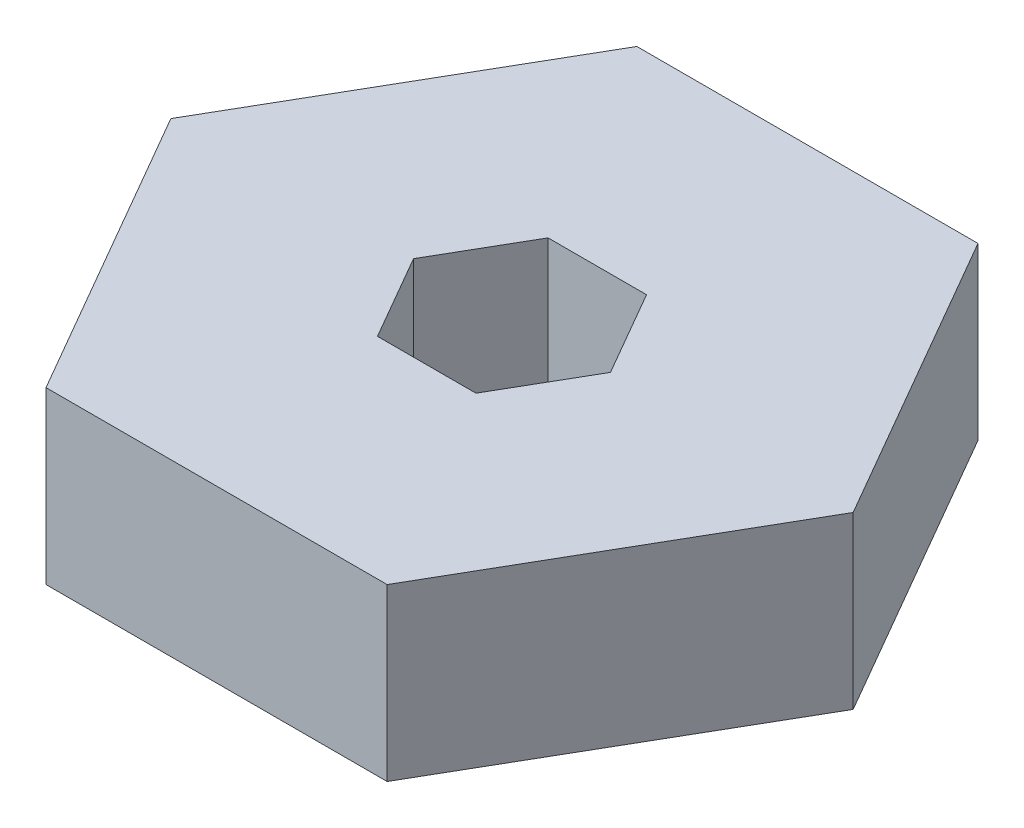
ISO-10303-21;
HEADER;
FILE_DESCRIPTION(('STEP AP214'),'2;1');
FILE_NAME('part.step','',(''),(''),'','','');
FILE_SCHEMA(('AUTOMOTIVE_DESIGN { 1 0 10303 214 1 1 1 1 }'));
ENDSEC;
DATA;
#1=APPLICATION_CONTEXT('core data for automotive mechanical design processes');
#2=APPLICATION_PROTOCOL_DEFINITION('international standard','automotive_design',2000,#1);
#3=PRODUCT_CONTEXT('',#1,'mechanical');
#4=PRODUCT('Part','Part','',(#3));
#5=PRODUCT_RELATED_PRODUCT_CATEGORY('part','',(#4));
#6=PRODUCT_DEFINITION_FORMATION('','',#4);
#7=PRODUCT_DEFINITION_CONTEXT('part definition',#1,'design');
#8=PRODUCT_DEFINITION('design','',#6,#7);
#9=PRODUCT_DEFINITION_SHAPE('','',#8);
#10=(LENGTH_UNIT() NAMED_UNIT(*) SI_UNIT(.MILLI.,.METRE.));
#11=(NAMED_UNIT(*) PLANE_ANGLE_UNIT() SI_UNIT($,.RADIAN.));
#12=(NAMED_UNIT(*) SI_UNIT($,.STERADIAN.) SOLID_ANGLE_UNIT());
#13=UNCERTAINTY_MEASURE_WITH_UNIT(LENGTH_MEASURE(1.E-05),#10,'distance_accuracy_value','');
#14=(GEOMETRIC_REPRESENTATION_CONTEXT(3) GLOBAL_UNCERTAINTY_ASSIGNED_CONTEXT((#13)) GLOBAL_UNIT_ASSIGNED_CONTEXT((#10,
#11,#12)) REPRESENTATION_CONTEXT('',''));
#15=CARTESIAN_POINT('',(0.,0.,0.));
#16=DIRECTION('',(0.,0.,1.));
#17=DIRECTION('',(1.,0.,0.));
#18=AXIS2_PLACEMENT_3D('',#15,#16,#17);
#19=CARTESIAN_POINT('',(0.,20.,0.));
#20=DIRECTION('',(0.,1.,0.));
#21=DIRECTION('',(0.,0.,1.));
#22=AXIS2_PLACEMENT_3D('',#19,#20,#21);
#23=PLANE('',#22);
#24=DIRECTION('',(0.5,0.,-0.866025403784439));
#25=VECTOR('',#24,1.);
#26=CARTESIAN_POINT('',(20.,20.,34.6410161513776));
#27=LINE('',#26,#25);
#28=CARTESIAN_POINT('',(20.,20.,34.6410161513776));
#29=VERTEX_POINT('',#28);
#30=CARTESIAN_POINT('',(40.,20.,0.));
#31=VERTEX_POINT('',#30);
#32=EDGE_CURVE('E173',#29,#31,#27,.T.);
#33=ORIENTED_EDGE('',*,*,#32,.T.);
#34=DIRECTION('',(-0.5,0.,-0.866025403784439));
#35=VECTOR('',#34,1.);
#36=CARTESIAN_POINT('',(40.,20.,0.));
#37=LINE('',#36,#35);
#38=CARTESIAN_POINT('',(20.,20.,-34.6410161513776));
#39=VERTEX_POINT('',#38);
#40=EDGE_CURVE('E176',#31,#39,#37,.T.);
#41=ORIENTED_EDGE('',*,*,#40,.T.);
#42=DIRECTION('',(-1.,0.,0.));
#43=VECTOR('',#42,1.);
#44=CARTESIAN_POINT('',(20.,20.,-34.6410161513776));
#45=LINE('',#44,#43);
#46=CARTESIAN_POINT('',(-20.,20.,-34.6410161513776));
#47=VERTEX_POINT('',#46);
#48=EDGE_CURVE('E179',#39,#47,#45,.T.);
#49=ORIENTED_EDGE('',*,*,#48,.T.);
#50=DIRECTION('',(-0.5,0.,0.866025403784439));
#51=VECTOR('',#50,1.);
#52=CARTESIAN_POINT('',(-20.,20.,-34.6410161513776));
#53=LINE('',#52,#51);
#54=CARTESIAN_POINT('',(-40.,20.,0.));
#55=VERTEX_POINT('',#54);
#56=EDGE_CURVE('E181',#47,#55,#53,.T.);
#57=ORIENTED_EDGE('',*,*,#56,.T.);
#58=DIRECTION('',(0.5,0.,0.866025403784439));
#59=VECTOR('',#58,1.);
#60=CARTESIAN_POINT('',(-40.,20.,0.));
#61=LINE('',#60,#59);
#62=CARTESIAN_POINT('',(-20.,20.,34.6410161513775));
#63=VERTEX_POINT('',#62);
#64=EDGE_CURVE('E183',#55,#63,#61,.T.);
#65=ORIENTED_EDGE('',*,*,#64,.T.);
#66=DIRECTION('',(1.,0.,0.));
#67=VECTOR('',#66,1.);
#68=CARTESIAN_POINT('',(-20.,20.,34.6410161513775));
#69=LINE('',#68,#67);
#70=EDGE_CURVE('E185',#63,#29,#69,.T.);
#71=ORIENTED_EDGE('',*,*,#70,.T.);
#72=EDGE_LOOP('',(#33,#41,#49,#57,#65,#71));
#73=FACE_BOUND('',#72,.T.);
#74=DIRECTION('',(-0.5,0.,-0.866025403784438));
#75=VECTOR('',#74,1.);
#76=CARTESIAN_POINT('',(11.5470053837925,20.,0.));
#77=LINE('',#76,#75);
#78=CARTESIAN_POINT('',(11.5470053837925,20.,0.));
#79=VERTEX_POINT('',#78);
#80=CARTESIAN_POINT('',(5.77350269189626,20.,-10.));
#81=VERTEX_POINT('',#80);
#82=EDGE_CURVE('E130',#79,#81,#77,.T.);
#83=ORIENTED_EDGE('',*,*,#82,.F.);
#84=DIRECTION('',(0.5,0.,-0.866025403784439));
#85=VECTOR('',#84,1.);
#86=CARTESIAN_POINT('',(5.77350269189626,20.,10.));
#87=LINE('',#86,#85);
#88=CARTESIAN_POINT('',(5.77350269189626,20.,10.));
#89=VERTEX_POINT('',#88);
#90=EDGE_CURVE('E122',#89,#79,#87,.T.);
#91=ORIENTED_EDGE('',*,*,#90,.F.);
#92=DIRECTION('',(1.,0.,0.));
#93=VECTOR('',#92,1.);
#94=CARTESIAN_POINT('',(-5.77350269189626,20.,10.));
#95=LINE('',#94,#93);
#96=CARTESIAN_POINT('',(-5.77350269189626,20.,10.));
#97=VERTEX_POINT('',#96);
#98=EDGE_CURVE('E151',#97,#89,#95,.T.);
#99=ORIENTED_EDGE('',*,*,#98,.F.);
#100=DIRECTION('',(0.5,0.,0.866025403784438));
#101=VECTOR('',#100,1.);
#102=CARTESIAN_POINT('',(-11.5470053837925,20.,0.));
#103=LINE('',#102,#101);
#104=CARTESIAN_POINT('',(-11.5470053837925,20.,0.));
#105=VERTEX_POINT('',#104);
#106=EDGE_CURVE('E149',#105,#97,#103,.T.);
#107=ORIENTED_EDGE('',*,*,#106,.F.);
#108=DIRECTION('',(-0.5,0.,0.866025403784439));
#109=VECTOR('',#108,1.);
#110=CARTESIAN_POINT('',(-5.77350269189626,20.,-10.));
#111=LINE('',#110,#109);
#112=CARTESIAN_POINT('',(-5.77350269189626,20.,-10.));
#113=VERTEX_POINT('',#112);
#114=EDGE_CURVE('E145',#113,#105,#111,.T.);
#115=ORIENTED_EDGE('',*,*,#114,.F.);
#116=DIRECTION('',(-1.,0.,0.));
#117=VECTOR('',#116,1.);
#118=CARTESIAN_POINT('',(5.77350269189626,20.,-10.));
#119=LINE('',#118,#117);
#120=EDGE_CURVE('E143',#81,#113,#119,.T.);
#121=ORIENTED_EDGE('',*,*,#120,.F.);
#122=EDGE_LOOP('',(#83,#91,#99,#107,#115,#121));
#123=FACE_BOUND('',#122,.T.);
#124=ADVANCED_FACE('F33',(#73,#123),#23,.T.);
#125=CARTESIAN_POINT('',(0.,0.,0.));
#126=DIRECTION('',(0.,1.,0.));
#127=DIRECTION('',(0.,0.,1.));
#128=AXIS2_PLACEMENT_3D('',#125,#126,#127);
#129=PLANE('',#128);
#130=DIRECTION('',(0.5,0.,-0.866025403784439));
#131=VECTOR('',#130,1.);
#132=CARTESIAN_POINT('',(20.,0.,34.6410161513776));
#133=LINE('',#132,#131);
#134=CARTESIAN_POINT('',(20.,0.,34.6410161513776));
#135=VERTEX_POINT('',#134);
#136=CARTESIAN_POINT('',(40.,0.,0.));
#137=VERTEX_POINT('',#136);
#138=EDGE_CURVE('E138',#135,#137,#133,.T.);
#139=ORIENTED_EDGE('',*,*,#138,.F.);
#140=DIRECTION('',(1.,0.,0.));
#141=VECTOR('',#140,1.);
#142=CARTESIAN_POINT('',(-20.,0.,34.6410161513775));
#143=LINE('',#142,#141);
#144=CARTESIAN_POINT('',(-20.,0.,34.6410161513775));
#145=VERTEX_POINT('',#144);
#146=EDGE_CURVE('E177',#145,#135,#143,.T.);
#147=ORIENTED_EDGE('',*,*,#146,.F.);
#148=DIRECTION('',(0.5,0.,0.866025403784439));
#149=VECTOR('',#148,1.);
#150=CARTESIAN_POINT('',(-40.,0.,0.));
#151=LINE('',#150,#149);
#152=CARTESIAN_POINT('',(-40.,0.,0.));
#153=VERTEX_POINT('',#152);
#154=EDGE_CURVE('E196',#153,#145,#151,.T.);
#155=ORIENTED_EDGE('',*,*,#154,.F.);
#156=DIRECTION('',(-0.5,0.,0.866025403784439));
#157=VECTOR('',#156,1.);
#158=CARTESIAN_POINT('',(-20.,0.,-34.6410161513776));
#159=LINE('',#158,#157);
#160=CARTESIAN_POINT('',(-20.,0.,-34.6410161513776));
#161=VERTEX_POINT('',#160);
#162=EDGE_CURVE('E194',#161,#153,#159,.T.);
#163=ORIENTED_EDGE('',*,*,#162,.F.);
#164=DIRECTION('',(-1.,0.,0.));
#165=VECTOR('',#164,1.);
#166=CARTESIAN_POINT('',(20.,0.,-34.6410161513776));
#167=LINE('',#166,#165);
#168=CARTESIAN_POINT('',(20.,0.,-34.6410161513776));
#169=VERTEX_POINT('',#168);
#170=EDGE_CURVE('E192',#169,#161,#167,.T.);
#171=ORIENTED_EDGE('',*,*,#170,.F.);
#172=DIRECTION('',(-0.5,0.,-0.866025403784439));
#173=VECTOR('',#172,1.);
#174=CARTESIAN_POINT('',(40.,0.,0.));
#175=LINE('',#174,#173);
#176=EDGE_CURVE('E190',#137,#169,#175,.T.);
#177=ORIENTED_EDGE('',*,*,#176,.F.);
#178=EDGE_LOOP('',(#139,#147,#155,#163,#171,#177));
#179=FACE_BOUND('',#178,.T.);
#180=DIRECTION('',(0.5,0.,-0.866025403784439));
#181=VECTOR('',#180,1.);
#182=CARTESIAN_POINT('',(5.77350269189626,0.,10.));
#183=LINE('',#182,#181);
#184=CARTESIAN_POINT('',(5.77350269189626,0.,10.));
#185=VERTEX_POINT('',#184);
#186=CARTESIAN_POINT('',(11.5470053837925,0.,0.));
#187=VERTEX_POINT('',#186);
#188=EDGE_CURVE('E56',#185,#187,#183,.T.);
#189=ORIENTED_EDGE('',*,*,#188,.T.);
#190=DIRECTION('',(-0.5,0.,-0.866025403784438));
#191=VECTOR('',#190,1.);
#192=CARTESIAN_POINT('',(11.5470053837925,0.,0.));
#193=LINE('',#192,#191);
#194=CARTESIAN_POINT('',(5.77350269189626,0.,-10.));
#195=VERTEX_POINT('',#194);
#196=EDGE_CURVE('E137',#187,#195,#193,.T.);
#197=ORIENTED_EDGE('',*,*,#196,.T.);
#198=DIRECTION('',(-1.,0.,0.));
#199=VECTOR('',#198,1.);
#200=CARTESIAN_POINT('',(5.77350269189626,0.,-10.));
#201=LINE('',#200,#199);
#202=CARTESIAN_POINT('',(-5.77350269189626,0.,-10.));
#203=VERTEX_POINT('',#202);
#204=EDGE_CURVE('E155',#195,#203,#201,.T.);
#205=ORIENTED_EDGE('',*,*,#204,.T.);
#206=DIRECTION('',(-0.5,0.,0.866025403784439));
#207=VECTOR('',#206,1.);
#208=CARTESIAN_POINT('',(-5.77350269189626,0.,-10.));
#209=LINE('',#208,#207);
#210=CARTESIAN_POINT('',(-11.5470053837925,0.,0.));
#211=VERTEX_POINT('',#210);
#212=EDGE_CURVE('E158',#203,#211,#209,.T.);
#213=ORIENTED_EDGE('',*,*,#212,.T.);
#214=DIRECTION('',(0.5,0.,0.866025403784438));
#215=VECTOR('',#214,1.);
#216=CARTESIAN_POINT('',(-11.5470053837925,0.,0.));
#217=LINE('',#216,#215);
#218=CARTESIAN_POINT('',(-5.77350269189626,0.,10.));
#219=VERTEX_POINT('',#218);
#220=EDGE_CURVE('E161',#211,#219,#217,.T.);
#221=ORIENTED_EDGE('',*,*,#220,.T.);
#222=DIRECTION('',(1.,0.,0.));
#223=VECTOR('',#222,1.);
#224=CARTESIAN_POINT('',(-5.77350269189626,0.,10.));
#225=LINE('',#224,#223);
#226=EDGE_CURVE('E131',#219,#185,#225,.T.);
#227=ORIENTED_EDGE('',*,*,#226,.T.);
#228=EDGE_LOOP('',(#189,#197,#205,#213,#221,#227));
#229=FACE_BOUND('',#228,.T.);
#230=ADVANCED_FACE('F220',(#179,#229),#129,.F.);
#231=CARTESIAN_POINT('',(20.,20.,34.6410161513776));
#232=DIRECTION('',(-0.866025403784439,0.,-0.5));
#233=DIRECTION('',(-0.5,0.,0.866025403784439));
#234=AXIS2_PLACEMENT_3D('',#231,#232,#233);
#235=PLANE('',#234);
#236=ORIENTED_EDGE('',*,*,#138,.T.);
#237=DIRECTION('',(0.,-1.,0.));
#238=VECTOR('',#237,1.);
#239=CARTESIAN_POINT('',(40.,20.,0.));
#240=LINE('',#239,#238);
#241=EDGE_CURVE('E11',#31,#137,#240,.T.);
#242=ORIENTED_EDGE('',*,*,#241,.F.);
#243=ORIENTED_EDGE('',*,*,#32,.F.);
#244=DIRECTION('',(0.,-1.,0.));
#245=VECTOR('',#244,1.);
#246=CARTESIAN_POINT('',(20.,20.,34.6410161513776));
#247=LINE('',#246,#245);
#248=EDGE_CURVE('E187',#29,#135,#247,.T.);
#249=ORIENTED_EDGE('',*,*,#248,.T.);
#250=EDGE_LOOP('',(#236,#242,#243,#249));
#251=FACE_BOUND('',#250,.T.);
#252=ADVANCED_FACE('F35',(#251),#235,.F.);
#253=CARTESIAN_POINT('',(40.,20.,0.));
#254=DIRECTION('',(-0.866025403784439,0.,0.5));
#255=DIRECTION('',(0.5,0.,0.866025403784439));
#256=AXIS2_PLACEMENT_3D('',#253,#254,#255);
#257=PLANE('',#256);
#258=ORIENTED_EDGE('',*,*,#176,.T.);
#259=DIRECTION('',(0.,-1.,0.));
#260=VECTOR('',#259,1.);
#261=CARTESIAN_POINT('',(20.,20.,-34.6410161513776));
#262=LINE('',#261,#260);
#263=EDGE_CURVE('E41',#39,#169,#262,.T.);
#264=ORIENTED_EDGE('',*,*,#263,.F.);
#265=ORIENTED_EDGE('',*,*,#40,.F.);
#266=ORIENTED_EDGE('',*,*,#241,.T.);
#267=EDGE_LOOP('',(#258,#264,#265,#266));
#268=FACE_BOUND('',#267,.T.);
#269=ADVANCED_FACE('F237',(#268),#257,.F.);
#270=CARTESIAN_POINT('',(20.,20.,-34.6410161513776));
#271=DIRECTION('',(0.,0.,1.));
#272=DIRECTION('',(1.,0.,0.));
#273=AXIS2_PLACEMENT_3D('',#270,#271,#272);
#274=PLANE('',#273);
#275=ORIENTED_EDGE('',*,*,#170,.T.);
#276=DIRECTION('',(0.,-1.,0.));
#277=VECTOR('',#276,1.);
#278=CARTESIAN_POINT('',(-20.,20.,-34.6410161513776));
#279=LINE('',#278,#277);
#280=EDGE_CURVE('E207',#47,#161,#279,.T.);
#281=ORIENTED_EDGE('',*,*,#280,.F.);
#282=ORIENTED_EDGE('',*,*,#48,.F.);
#283=ORIENTED_EDGE('',*,*,#263,.T.);
#284=EDGE_LOOP('',(#275,#281,#282,#283));
#285=FACE_BOUND('',#284,.T.);
#286=ADVANCED_FACE('F214',(#285),#274,.F.);
#287=CARTESIAN_POINT('',(-20.,20.,-34.6410161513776));
#288=DIRECTION('',(0.866025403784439,0.,0.5));
#289=DIRECTION('',(0.5,0.,-0.866025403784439));
#290=AXIS2_PLACEMENT_3D('',#287,#288,#289);
#291=PLANE('',#290);
#292=ORIENTED_EDGE('',*,*,#162,.T.);
#293=DIRECTION('',(0.,-1.,0.));
#294=VECTOR('',#293,1.);
#295=CARTESIAN_POINT('',(-40.,20.,0.));
#296=LINE('',#295,#294);
#297=EDGE_CURVE('E204',#55,#153,#296,.T.);
#298=ORIENTED_EDGE('',*,*,#297,.F.);
#299=ORIENTED_EDGE('',*,*,#56,.F.);
#300=ORIENTED_EDGE('',*,*,#280,.T.);
#301=EDGE_LOOP('',(#292,#298,#299,#300));
#302=FACE_BOUND('',#301,.T.);
#303=ADVANCED_FACE('F226',(#302),#291,.F.);
#304=CARTESIAN_POINT('',(-40.,20.,0.));
#305=DIRECTION('',(0.866025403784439,0.,-0.5));
#306=DIRECTION('',(-0.5,0.,-0.866025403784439));
#307=AXIS2_PLACEMENT_3D('',#304,#305,#306);
#308=PLANE('',#307);
#309=ORIENTED_EDGE('',*,*,#154,.T.);
#310=DIRECTION('',(0.,-1.,0.));
#311=VECTOR('',#310,1.);
#312=CARTESIAN_POINT('',(-20.,20.,34.6410161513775));
#313=LINE('',#312,#311);
#314=EDGE_CURVE('E201',#63,#145,#313,.T.);
#315=ORIENTED_EDGE('',*,*,#314,.F.);
#316=ORIENTED_EDGE('',*,*,#64,.F.);
#317=ORIENTED_EDGE('',*,*,#297,.T.);
#318=EDGE_LOOP('',(#309,#315,#316,#317));
#319=FACE_BOUND('',#318,.T.);
#320=ADVANCED_FACE('F230',(#319),#308,.F.);
#321=CARTESIAN_POINT('',(-20.,20.,34.6410161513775));
#322=DIRECTION('',(0.,0.,-1.));
#323=DIRECTION('',(-1.,0.,0.));
#324=AXIS2_PLACEMENT_3D('',#321,#322,#323);
#325=PLANE('',#324);
#326=ORIENTED_EDGE('',*,*,#146,.T.);
#327=ORIENTED_EDGE('',*,*,#248,.F.);
#328=ORIENTED_EDGE('',*,*,#70,.F.);
#329=ORIENTED_EDGE('',*,*,#314,.T.);
#330=EDGE_LOOP('',(#326,#327,#328,#329));
#331=FACE_BOUND('',#330,.T.);
#332=ADVANCED_FACE('F240',(#331),#325,.F.);
#333=CARTESIAN_POINT('',(5.77350269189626,20.,10.));
#334=DIRECTION('',(-0.866025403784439,0.,-0.5));
#335=DIRECTION('',(-0.5,0.,0.866025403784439));
#336=AXIS2_PLACEMENT_3D('',#333,#334,#335);
#337=PLANE('',#336);
#338=ORIENTED_EDGE('',*,*,#188,.F.);
#339=DIRECTION('',(0.,-1.,0.));
#340=VECTOR('',#339,1.);
#341=CARTESIAN_POINT('',(5.77350269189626,20.,10.));
#342=LINE('',#341,#340);
#343=EDGE_CURVE('E126',#89,#185,#342,.T.);
#344=ORIENTED_EDGE('',*,*,#343,.F.);
#345=ORIENTED_EDGE('',*,*,#90,.T.);
#346=DIRECTION('',(0.,-1.,0.));
#347=VECTOR('',#346,1.);
#348=CARTESIAN_POINT('',(11.5470053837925,20.,0.));
#349=LINE('',#348,#347);
#350=EDGE_CURVE('E125',#79,#187,#349,.T.);
#351=ORIENTED_EDGE('',*,*,#350,.T.);
#352=EDGE_LOOP('',(#338,#344,#345,#351));
#353=FACE_BOUND('',#352,.T.);
#354=ADVANCED_FACE('F124',(#353),#337,.T.);
#355=CARTESIAN_POINT('',(11.5470053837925,20.,0.));
#356=DIRECTION('',(-0.866025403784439,0.,0.5));
#357=DIRECTION('',(0.5,0.,0.866025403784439));
#358=AXIS2_PLACEMENT_3D('',#355,#356,#357);
#359=PLANE('',#358);
#360=ORIENTED_EDGE('',*,*,#196,.F.);
#361=ORIENTED_EDGE('',*,*,#350,.F.);
#362=ORIENTED_EDGE('',*,*,#82,.T.);
#363=DIRECTION('',(0.,-1.,0.));
#364=VECTOR('',#363,1.);
#365=CARTESIAN_POINT('',(5.77350269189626,20.,-10.));
#366=LINE('',#365,#364);
#367=EDGE_CURVE('E139',#81,#195,#366,.T.);
#368=ORIENTED_EDGE('',*,*,#367,.T.);
#369=EDGE_LOOP('',(#360,#361,#362,#368));
#370=FACE_BOUND('',#369,.T.);
#371=ADVANCED_FACE('F134',(#370),#359,.T.);
#372=CARTESIAN_POINT('',(5.77350269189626,20.,-10.));
#373=DIRECTION('',(0.,0.,1.));
#374=DIRECTION('',(1.,0.,0.));
#375=AXIS2_PLACEMENT_3D('',#372,#373,#374);
#376=PLANE('',#375);
#377=ORIENTED_EDGE('',*,*,#204,.F.);
#378=ORIENTED_EDGE('',*,*,#367,.F.);
#379=ORIENTED_EDGE('',*,*,#120,.T.);
#380=DIRECTION('',(0.,-1.,0.));
#381=VECTOR('',#380,1.);
#382=CARTESIAN_POINT('',(-5.77350269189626,20.,-10.));
#383=LINE('',#382,#381);
#384=EDGE_CURVE('E170',#113,#203,#383,.T.);
#385=ORIENTED_EDGE('',*,*,#384,.T.);
#386=EDGE_LOOP('',(#377,#378,#379,#385));
#387=FACE_BOUND('',#386,.T.);
#388=ADVANCED_FACE('F258',(#387),#376,.T.);
#389=CARTESIAN_POINT('',(-5.77350269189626,20.,-10.));
#390=DIRECTION('',(0.866025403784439,0.,0.5));
#391=DIRECTION('',(0.5,0.,-0.866025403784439));
#392=AXIS2_PLACEMENT_3D('',#389,#390,#391);
#393=PLANE('',#392);
#394=ORIENTED_EDGE('',*,*,#212,.F.);
#395=ORIENTED_EDGE('',*,*,#384,.F.);
#396=ORIENTED_EDGE('',*,*,#114,.T.);
#397=DIRECTION('',(0.,-1.,0.));
#398=VECTOR('',#397,1.);
#399=CARTESIAN_POINT('',(-11.5470053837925,20.,0.));
#400=LINE('',#399,#398);
#401=EDGE_CURVE('E168',#105,#211,#400,.T.);
#402=ORIENTED_EDGE('',*,*,#401,.T.);
#403=EDGE_LOOP('',(#394,#395,#396,#402));
#404=FACE_BOUND('',#403,.T.);
#405=ADVANCED_FACE('F261',(#404),#393,.T.);
#406=CARTESIAN_POINT('',(-11.5470053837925,20.,0.));
#407=DIRECTION('',(0.866025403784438,0.,-0.5));
#408=DIRECTION('',(-0.5,0.,-0.866025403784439));
#409=AXIS2_PLACEMENT_3D('',#406,#407,#408);
#410=PLANE('',#409);
#411=ORIENTED_EDGE('',*,*,#220,.F.);
#412=ORIENTED_EDGE('',*,*,#401,.F.);
#413=ORIENTED_EDGE('',*,*,#106,.T.);
#414=DIRECTION('',(0.,-1.,0.));
#415=VECTOR('',#414,1.);
#416=CARTESIAN_POINT('',(-5.77350269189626,20.,10.));
#417=LINE('',#416,#415);
#418=EDGE_CURVE('E48',#97,#219,#417,.T.);
#419=ORIENTED_EDGE('',*,*,#418,.T.);
#420=EDGE_LOOP('',(#411,#412,#413,#419));
#421=FACE_BOUND('',#420,.T.);
#422=ADVANCED_FACE('F265',(#421),#410,.T.);
#423=CARTESIAN_POINT('',(-5.77350269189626,20.,10.));
#424=DIRECTION('',(0.,0.,-1.));
#425=DIRECTION('',(-1.,0.,0.));
#426=AXIS2_PLACEMENT_3D('',#423,#424,#425);
#427=PLANE('',#426);
#428=ORIENTED_EDGE('',*,*,#226,.F.);
#429=ORIENTED_EDGE('',*,*,#418,.F.);
#430=ORIENTED_EDGE('',*,*,#98,.T.);
#431=ORIENTED_EDGE('',*,*,#343,.T.);
#432=EDGE_LOOP('',(#428,#429,#430,#431));
#433=FACE_BOUND('',#432,.T.);
#434=ADVANCED_FACE('F269',(#433),#427,.T.);
#435=CLOSED_SHELL('',(#124,#230,#252,#269,#286,#303,#320,#332,#354,#371,#388,#405,#422,#434));
#436=MANIFOLD_SOLID_BREP('B2',#435);
#437=ADVANCED_BREP_SHAPE_REPRESENTATION('',(#18,#436),#14);
#438=SHAPE_DEFINITION_REPRESENTATION(#9,#437);
ENDSEC;
END-ISO-10303-21;
